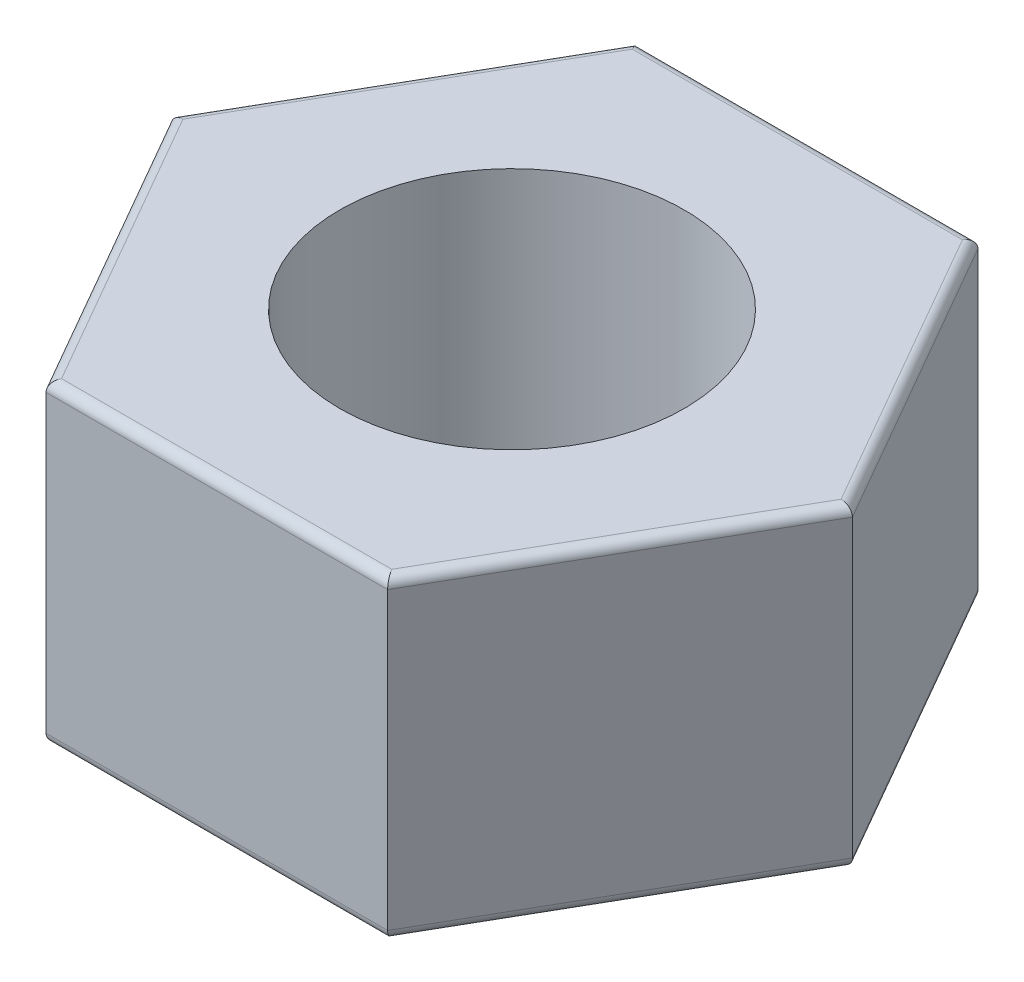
from build123d import *

# Parameters (mm, degrees)
ESQUISSE1_R      = 8.75
EXTRUSION1_DEPTH = 16
CONG_1_R         = 0.5


with BuildPart() as part:
    # Esquisse1 → Extrusion1 (new body)
    with BuildSketch(Plane(origin=(0, 0, 0), x_dir=(1, 0, 0), z_dir=(0, 1, 0))):
        Polygon((-8.680835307, 15), (8.680835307, 15), (17.3, 0), (8.680835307, -15), (-8.680835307, -15), (-17.3, 0), align=None)
        with Locations(Location((0, 0, 0), (0, 0, 270))):
            Circle(ESQUISSE1_R, mode=Mode.SUBTRACT)
    extrude(amount=EXTRUSION1_DEPTH)

    # Cong_1
    cong_1_edges = [part.edges().sort_by_distance(p)[0] for p in [
        (12.990417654, 16, -7.5),
        (0, 16, -15),
        (-12.990417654, 16, -7.5),
        (-12.990417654, 16, 7.5),
        (0, 16, 15),
        (-12.990417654, 0, 7.5),
        (-12.990417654, 0, -7.5),
        (0, 0, -15),
        (12.990417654, 0, -7.5),
        (12.990417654, 16, 7.5),
        (12.990417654, 0, 7.5),
        (0, 0, 15),
    ]]
    fillet(cong_1_edges, radius=CONG_1_R)


solid = part.part
